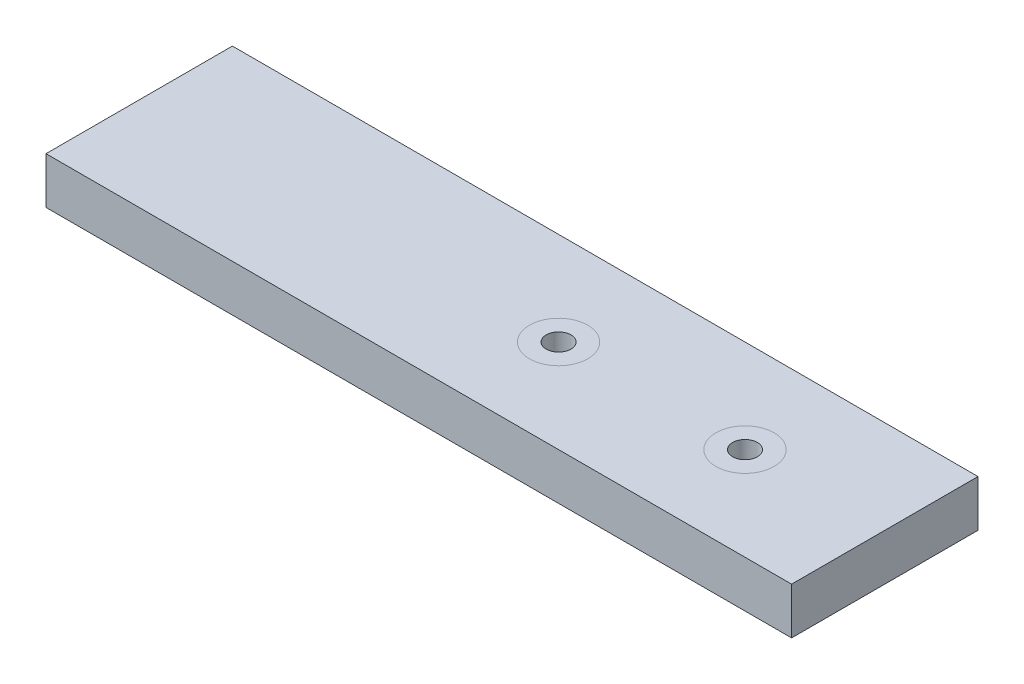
from build123d import *

# Parameters (mm, degrees)
SKETCH1_W               = 203.2
SKETCH1_H               = 50.8
EXTRUDE1_DEPTH          = 12.7
F_1_4_CLEARANCE_HOLE1_D = 6.7564


with BuildPart() as part:
    # Sketch1 → Extrude1 (new body)
    with BuildSketch(Plane(origin=(0, 0, 0), x_dir=(1, 0, 0), z_dir=(0, 1, 0))):
        with Locations((101.6, 0)):
            Rectangle(SKETCH1_W, SKETCH1_H)
    extrude(amount=EXTRUDE1_DEPTH)

    # 1_4 Clearance Hole1 (through all)
    with Locations(Plane(origin=(0, 12.7, 0), x_dir=(-1, 0, 0), z_dir=(0, 1, 0))):
        with Locations((-165.1, 0), (-114.3, 0)):
            Hole(F_1_4_CLEARANCE_HOLE1_D / 2)


solid = part.part
